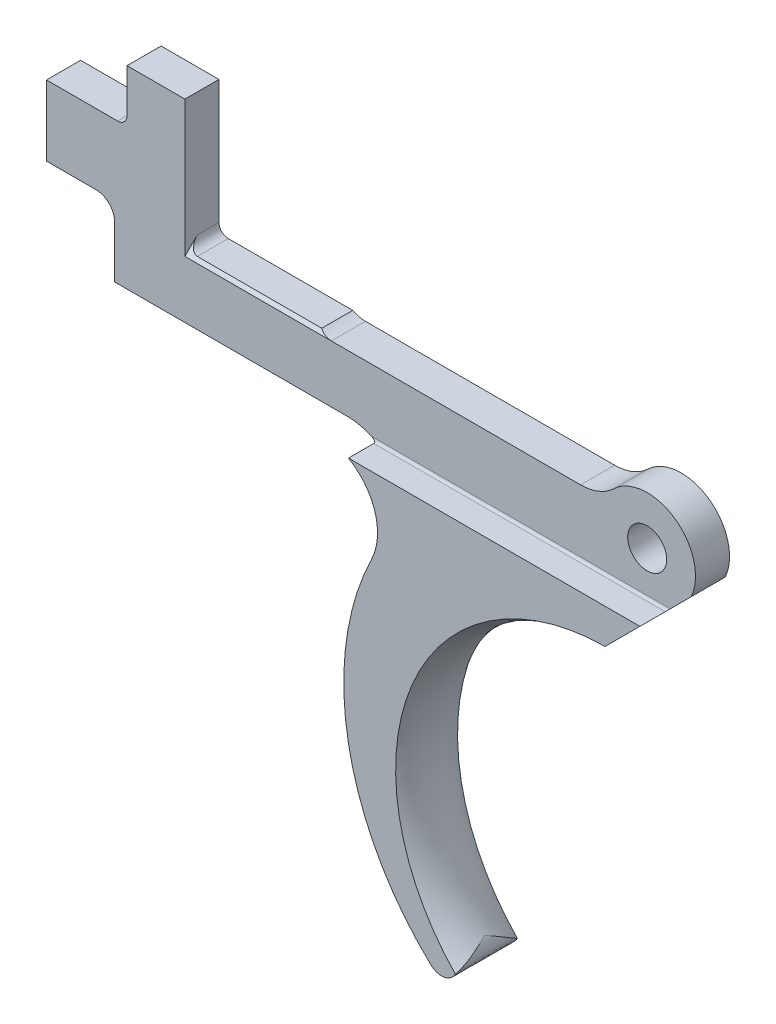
ISO-10303-21;
HEADER;
FILE_DESCRIPTION(('STEP AP214'),'2;1');
FILE_NAME('part.step','',(''),(''),'','','');
FILE_SCHEMA(('AUTOMOTIVE_DESIGN { 1 0 10303 214 1 1 1 1 }'));
ENDSEC;
DATA;
#1=APPLICATION_CONTEXT('core data for automotive mechanical design processes');
#2=APPLICATION_PROTOCOL_DEFINITION('international standard','automotive_design',2000,#1);
#3=PRODUCT_CONTEXT('',#1,'mechanical');
#4=PRODUCT('Part','Part','',(#3));
#5=PRODUCT_RELATED_PRODUCT_CATEGORY('part','',(#4));
#6=PRODUCT_DEFINITION_FORMATION('','',#4);
#7=PRODUCT_DEFINITION_CONTEXT('part definition',#1,'design');
#8=PRODUCT_DEFINITION('design','',#6,#7);
#9=PRODUCT_DEFINITION_SHAPE('','',#8);
#10=(LENGTH_UNIT() NAMED_UNIT(*) SI_UNIT(.MILLI.,.METRE.));
#11=(NAMED_UNIT(*) PLANE_ANGLE_UNIT() SI_UNIT($,.RADIAN.));
#12=(NAMED_UNIT(*) SI_UNIT($,.STERADIAN.) SOLID_ANGLE_UNIT());
#13=UNCERTAINTY_MEASURE_WITH_UNIT(LENGTH_MEASURE(1.E-05),#10,'distance_accuracy_value','');
#14=(GEOMETRIC_REPRESENTATION_CONTEXT(3) GLOBAL_UNCERTAINTY_ASSIGNED_CONTEXT((#13)) GLOBAL_UNIT_ASSIGNED_CONTEXT((#10,
#11,#12)) REPRESENTATION_CONTEXT('',''));
#15=CARTESIAN_POINT('',(0.,0.,0.));
#16=DIRECTION('',(0.,0.,1.));
#17=DIRECTION('',(1.,0.,0.));
#18=AXIS2_PLACEMENT_3D('',#15,#16,#17);
#19=CARTESIAN_POINT('',(-37.1602,2.794,2.54));
#20=DIRECTION('',(0.,0.,-1.));
#21=DIRECTION('',(-1.,0.,0.));
#22=AXIS2_PLACEMENT_3D('',#19,#20,#21);
#23=CYLINDRICAL_SURFACE('',#22,0.761999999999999);
#24=DIRECTION('',(0.,0.,-1.));
#25=VECTOR('',#24,1.);
#26=CARTESIAN_POINT('',(-37.9222,2.794,2.54));
#27=LINE('',#26,#25);
#28=CARTESIAN_POINT('',(-37.9222,2.794,-0.761999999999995));
#29=VERTEX_POINT('',#28);
#30=CARTESIAN_POINT('',(-37.9222,2.794,-2.54));
#31=VERTEX_POINT('',#30);
#32=EDGE_CURVE('E220',#29,#31,#27,.T.);
#33=ORIENTED_EDGE('',*,*,#32,.F.);
#34=CARTESIAN_POINT('',(-37.1602,2.794,-0.76199999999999));
#35=DIRECTION('',(0.,-0.707106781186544,-0.707106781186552));
#36=DIRECTION('',(0.,0.707106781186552,-0.707106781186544));
#37=AXIS2_PLACEMENT_3D('',#34,#35,#36);
#38=ELLIPSE('',#37,1.07763073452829,0.761999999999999);
#39=CARTESIAN_POINT('',(-37.1602,2.032,0.));
#40=VERTEX_POINT('',#39);
#41=EDGE_CURVE('E205',#29,#40,#38,.F.);
#42=ORIENTED_EDGE('',*,*,#41,.T.);
#43=DIRECTION('',(0.,0.,-1.));
#44=VECTOR('',#43,1.);
#45=CARTESIAN_POINT('',(-37.1602,2.032,2.54));
#46=LINE('',#45,#44);
#47=CARTESIAN_POINT('',(-37.1602,2.032,-2.54));
#48=VERTEX_POINT('',#47);
#49=EDGE_CURVE('E228',#40,#48,#46,.T.);
#50=ORIENTED_EDGE('',*,*,#49,.T.);
#51=CARTESIAN_POINT('',(-37.1602,2.794,-2.54));
#52=DIRECTION('',(0.,0.,-1.));
#53=DIRECTION('',(1.,0.,0.));
#54=AXIS2_PLACEMENT_3D('',#51,#52,#53);
#55=CIRCLE('',#54,0.761999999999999);
#56=EDGE_CURVE('E226',#48,#31,#55,.T.);
#57=ORIENTED_EDGE('',*,*,#56,.T.);
#58=EDGE_LOOP('',(#33,#42,#50,#57));
#59=FACE_BOUND('',#58,.T.);
#60=ADVANCED_FACE('F41',(#59),#23,.F.);
#61=CARTESIAN_POINT('',(-37.1602,2.794,0.254));
#62=DIRECTION('',(0.,0.,1.));
#63=DIRECTION('',(1.,0.,0.));
#64=AXIS2_PLACEMENT_3D('',#61,#62,#63);
#65=PLANE('',#64);
#66=CARTESIAN_POINT('',(0.,0.,0.254));
#67=DIRECTION('',(0.,0.,1.));
#68=DIRECTION('',(1.,0.,0.));
#69=AXIS2_PLACEMENT_3D('',#66,#67,#68);
#70=CIRCLE('',#69,1.6002);
#71=CARTESIAN_POINT('',(1.6002,0.,0.254));
#72=VERTEX_POINT('',#71);
#73=EDGE_CURVE('E434',#72,#72,#70,.T.);
#74=ORIENTED_EDGE('',*,*,#73,.F.);
#75=EDGE_LOOP('',(#74));
#76=FACE_BOUND('',#75,.T.);
#77=DIRECTION('',(1.,0.,0.));
#78=VECTOR('',#77,1.);
#79=CARTESIAN_POINT('',(-37.9222,1.778,0.254));
#80=LINE('',#79,#78);
#81=CARTESIAN_POINT('',(-37.9222,1.778,0.254));
#82=VERTEX_POINT('',#81);
#83=CARTESIAN_POINT('',(-25.908,1.778,0.254));
#84=VERTEX_POINT('',#83);
#85=EDGE_CURVE('E215',#82,#84,#80,.T.);
#86=ORIENTED_EDGE('',*,*,#85,.F.);
#87=DIRECTION('',(0.,1.,0.));
#88=VECTOR('',#87,1.);
#89=CARTESIAN_POINT('',(-37.9222,12.954,0.254));
#90=LINE('',#89,#88);
#91=CARTESIAN_POINT('',(-37.9222,12.954,0.254));
#92=VERTEX_POINT('',#91);
#93=EDGE_CURVE('E223',#82,#92,#90,.T.);
#94=ORIENTED_EDGE('',*,*,#93,.T.);
#95=DIRECTION('',(-1.,0.,0.));
#96=VECTOR('',#95,1.);
#97=CARTESIAN_POINT('',(-42.672,12.954,0.254));
#98=LINE('',#97,#96);
#99=CARTESIAN_POINT('',(-42.672,12.954,0.254));
#100=VERTEX_POINT('',#99);
#101=EDGE_CURVE('E437',#92,#100,#98,.T.);
#102=ORIENTED_EDGE('',*,*,#101,.T.);
#103=DIRECTION('',(0.,-1.,0.));
#104=VECTOR('',#103,1.);
#105=CARTESIAN_POINT('',(-42.672,9.398,0.254));
#106=LINE('',#105,#104);
#107=CARTESIAN_POINT('',(-42.672,9.39799999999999,0.254));
#108=VERTEX_POINT('',#107);
#109=EDGE_CURVE('E527',#100,#108,#106,.T.);
#110=ORIENTED_EDGE('',*,*,#109,.T.);
#111=CARTESIAN_POINT('',(-43.434,9.39799999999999,0.254));
#112=DIRECTION('',(0.,0.,1.));
#113=DIRECTION('',(1.,0.,0.));
#114=AXIS2_PLACEMENT_3D('',#111,#112,#113);
#115=CIRCLE('',#114,0.762);
#116=CARTESIAN_POINT('',(-43.434,8.63599999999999,0.254));
#117=VERTEX_POINT('',#116);
#118=EDGE_CURVE('E526',#108,#117,#115,.F.);
#119=ORIENTED_EDGE('',*,*,#118,.T.);
#120=DIRECTION('',(-1.,0.,0.));
#121=VECTOR('',#120,1.);
#122=CARTESIAN_POINT('',(-49.276,8.63599999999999,0.254));
#123=LINE('',#122,#121);
#124=CARTESIAN_POINT('',(-49.276,8.63599999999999,0.254));
#125=VERTEX_POINT('',#124);
#126=EDGE_CURVE('E559',#117,#125,#123,.T.);
#127=ORIENTED_EDGE('',*,*,#126,.T.);
#128=DIRECTION('',(0.,-1.,0.));
#129=VECTOR('',#128,1.);
#130=CARTESIAN_POINT('',(-49.276,2.8702,0.254));
#131=LINE('',#130,#129);
#132=CARTESIAN_POINT('',(-49.276,2.8702,0.254));
#133=VERTEX_POINT('',#132);
#134=EDGE_CURVE('E557',#125,#133,#131,.T.);
#135=ORIENTED_EDGE('',*,*,#134,.T.);
#136=DIRECTION('',(1.,0.,0.));
#137=VECTOR('',#136,1.);
#138=CARTESIAN_POINT('',(-49.276,2.8702,0.254));
#139=LINE('',#138,#137);
#140=CARTESIAN_POINT('',(-45.212,2.8702,0.254));
#141=VERTEX_POINT('',#140);
#142=EDGE_CURVE('E555',#133,#141,#139,.T.);
#143=ORIENTED_EDGE('',*,*,#142,.T.);
#144=CARTESIAN_POINT('',(-45.212,1.3462,0.254));
#145=DIRECTION('',(0.,0.,1.));
#146=DIRECTION('',(1.,0.,0.));
#147=AXIS2_PLACEMENT_3D('',#144,#145,#146);
#148=CIRCLE('',#147,1.524);
#149=CARTESIAN_POINT('',(-43.688,1.3462,0.254));
#150=VERTEX_POINT('',#149);
#151=EDGE_CURVE('E553',#141,#150,#148,.F.);
#152=ORIENTED_EDGE('',*,*,#151,.T.);
#153=DIRECTION('',(0.,-1.,0.));
#154=VECTOR('',#153,1.);
#155=CARTESIAN_POINT('',(-43.688,1.34619999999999,0.254));
#156=LINE('',#155,#154);
#157=CARTESIAN_POINT('',(-43.688,-2.92100000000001,0.254));
#158=VERTEX_POINT('',#157);
#159=EDGE_CURVE('E551',#150,#158,#156,.T.);
#160=ORIENTED_EDGE('',*,*,#159,.T.);
#161=DIRECTION('',(1.,0.,0.));
#162=VECTOR('',#161,1.);
#163=CARTESIAN_POINT('',(-43.688,-2.92100000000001,0.254));
#164=LINE('',#163,#162);
#165=CARTESIAN_POINT('',(-24.5967231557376,-2.92100000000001,0.254));
#166=VERTEX_POINT('',#165);
#167=EDGE_CURVE('E549',#158,#166,#164,.T.);
#168=ORIENTED_EDGE('',*,*,#167,.T.);
#169=CARTESIAN_POINT('',(-24.5967231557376,-7.68350000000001,0.254));
#170=DIRECTION('',(0.,0.,1.));
#171=DIRECTION('',(1.,0.,0.));
#172=AXIS2_PLACEMENT_3D('',#169,#170,#171);
#173=CIRCLE('',#172,4.7625);
#174=CARTESIAN_POINT('',(-22.6151975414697,-3.3528,0.254));
#175=VERTEX_POINT('',#174);
#176=EDGE_CURVE('E547',#166,#175,#173,.F.);
#177=ORIENTED_EDGE('',*,*,#176,.T.);
#178=DIRECTION('',(-1.,0.,0.));
#179=VECTOR('',#178,1.);
#180=CARTESIAN_POINT('',(-37.1602,-3.3528,0.254));
#181=LINE('',#180,#179);
#182=CARTESIAN_POINT('',(1.89166957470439,-3.3528,0.254));
#183=VERTEX_POINT('',#182);
#184=EDGE_CURVE('E57',#175,#183,#181,.F.);
#185=ORIENTED_EDGE('',*,*,#184,.T.);
#186=DIRECTION('',(0.707106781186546,0.707106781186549,0.));
#187=VECTOR('',#186,1.);
#188=CARTESIAN_POINT('',(3.60924623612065,-1.63522333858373,0.254));
#189=LINE('',#188,#187);
#190=CARTESIAN_POINT('',(3.60924623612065,-1.63522333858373,0.254));
#191=VERTEX_POINT('',#190);
#192=EDGE_CURVE('E522',#183,#191,#189,.T.);
#193=ORIENTED_EDGE('',*,*,#192,.T.);
#194=CARTESIAN_POINT('',(0.,0.,0.254));
#195=DIRECTION('',(0.,0.,1.));
#196=DIRECTION('',(1.,0.,0.));
#197=AXIS2_PLACEMENT_3D('',#194,#195,#196);
#198=CIRCLE('',#197,3.9624);
#199=CARTESIAN_POINT('',(-2.73176970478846,2.8702,0.254));
#200=VERTEX_POINT('',#199);
#201=EDGE_CURVE('E563',#191,#200,#198,.T.);
#202=ORIENTED_EDGE('',*,*,#201,.T.);
#203=CARTESIAN_POINT('',(-5.46353940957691,5.7404,0.254));
#204=DIRECTION('',(0.,0.,1.));
#205=DIRECTION('',(1.,0.,0.));
#206=AXIS2_PLACEMENT_3D('',#203,#204,#205);
#207=CIRCLE('',#206,3.9624);
#208=CARTESIAN_POINT('',(-5.46353940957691,1.778,0.254));
#209=VERTEX_POINT('',#208);
#210=EDGE_CURVE('E565',#200,#209,#207,.F.);
#211=ORIENTED_EDGE('',*,*,#210,.T.);
#212=DIRECTION('',(-1.,0.,0.));
#213=VECTOR('',#212,1.);
#214=CARTESIAN_POINT('',(-25.908,1.778,0.254));
#215=LINE('',#214,#213);
#216=EDGE_CURVE('E567',#209,#84,#215,.T.);
#217=ORIENTED_EDGE('',*,*,#216,.T.);
#218=EDGE_LOOP('',(#86,#94,#102,#110,#119,#127,#135,#143,#152,#160,#168,#177,#185,#193,#202,
#211,#217));
#219=FACE_BOUND('',#218,.T.);
#220=ADVANCED_FACE('F483',(#76,#219),#65,.T.);
#221=CARTESIAN_POINT('',(-42.672,9.398,2.54));
#222=DIRECTION('',(1.,0.,0.));
#223=DIRECTION('',(0.,0.,-1.));
#224=AXIS2_PLACEMENT_3D('',#221,#222,#223);
#225=PLANE('',#224);
#226=ORIENTED_EDGE('',*,*,#109,.F.);
#227=DIRECTION('',(0.,0.,-1.));
#228=VECTOR('',#227,1.);
#229=CARTESIAN_POINT('',(-42.672,12.954,2.54));
#230=LINE('',#229,#228);
#231=CARTESIAN_POINT('',(-42.672,12.954,-2.54));
#232=VERTEX_POINT('',#231);
#233=EDGE_CURVE('E233',#100,#232,#230,.T.);
#234=ORIENTED_EDGE('',*,*,#233,.T.);
#235=DIRECTION('',(0.,-1.,0.));
#236=VECTOR('',#235,1.);
#237=CARTESIAN_POINT('',(-42.672,9.398,-2.54));
#238=LINE('',#237,#236);
#239=CARTESIAN_POINT('',(-42.672,9.39799999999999,-2.54));
#240=VERTEX_POINT('',#239);
#241=EDGE_CURVE('E317',#232,#240,#238,.T.);
#242=ORIENTED_EDGE('',*,*,#241,.T.);
#243=DIRECTION('',(0.,0.,-1.));
#244=VECTOR('',#243,1.);
#245=CARTESIAN_POINT('',(-42.672,9.39799999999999,2.54));
#246=LINE('',#245,#244);
#247=EDGE_CURVE('E263',#108,#240,#246,.T.);
#248=ORIENTED_EDGE('',*,*,#247,.F.);
#249=EDGE_LOOP('',(#226,#234,#242,#248));
#250=FACE_BOUND('',#249,.T.);
#251=ADVANCED_FACE('F394',(#250),#225,.F.);
#252=CARTESIAN_POINT('',(-43.434,9.39799999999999,2.54));
#253=DIRECTION('',(0.,0.,-1.));
#254=DIRECTION('',(-1.,0.,0.));
#255=AXIS2_PLACEMENT_3D('',#252,#253,#254);
#256=CYLINDRICAL_SURFACE('',#255,0.762);
#257=ORIENTED_EDGE('',*,*,#118,.F.);
#258=ORIENTED_EDGE('',*,*,#247,.T.);
#259=CARTESIAN_POINT('',(-43.434,9.39799999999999,-2.54));
#260=DIRECTION('',(0.,0.,-1.));
#261=DIRECTION('',(1.,0.,0.));
#262=AXIS2_PLACEMENT_3D('',#259,#260,#261);
#263=CIRCLE('',#262,0.762);
#264=CARTESIAN_POINT('',(-43.434,8.63599999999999,-2.54));
#265=VERTEX_POINT('',#264);
#266=EDGE_CURVE('E319',#240,#265,#263,.T.);
#267=ORIENTED_EDGE('',*,*,#266,.T.);
#268=DIRECTION('',(0.,0.,-1.));
#269=VECTOR('',#268,1.);
#270=CARTESIAN_POINT('',(-43.434,8.63599999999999,2.54));
#271=LINE('',#270,#269);
#272=EDGE_CURVE('E261',#117,#265,#271,.T.);
#273=ORIENTED_EDGE('',*,*,#272,.F.);
#274=EDGE_LOOP('',(#257,#258,#267,#273));
#275=FACE_BOUND('',#274,.T.);
#276=ADVANCED_FACE('F476',(#275),#256,.F.);
#277=CARTESIAN_POINT('',(-49.276,8.63599999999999,2.54));
#278=DIRECTION('',(0.,-1.,0.));
#279=DIRECTION('',(0.,0.,-1.));
#280=AXIS2_PLACEMENT_3D('',#277,#278,#279);
#281=PLANE('',#280);
#282=ORIENTED_EDGE('',*,*,#126,.F.);
#283=ORIENTED_EDGE('',*,*,#272,.T.);
#284=DIRECTION('',(-1.,0.,0.));
#285=VECTOR('',#284,1.);
#286=CARTESIAN_POINT('',(-49.276,8.63599999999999,-2.54));
#287=LINE('',#286,#285);
#288=CARTESIAN_POINT('',(-49.276,8.63599999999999,-2.54));
#289=VERTEX_POINT('',#288);
#290=EDGE_CURVE('E323',#265,#289,#287,.T.);
#291=ORIENTED_EDGE('',*,*,#290,.T.);
#292=DIRECTION('',(0.,0.,-1.));
#293=VECTOR('',#292,1.);
#294=CARTESIAN_POINT('',(-49.276,8.63599999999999,2.54));
#295=LINE('',#294,#293);
#296=EDGE_CURVE('E259',#125,#289,#295,.T.);
#297=ORIENTED_EDGE('',*,*,#296,.F.);
#298=EDGE_LOOP('',(#282,#283,#291,#297));
#299=FACE_BOUND('',#298,.T.);
#300=ADVANCED_FACE('F473',(#299),#281,.F.);
#301=CARTESIAN_POINT('',(-49.276,2.8702,2.54));
#302=DIRECTION('',(1.,0.,0.));
#303=DIRECTION('',(0.,0.,-1.));
#304=AXIS2_PLACEMENT_3D('',#301,#302,#303);
#305=PLANE('',#304);
#306=ORIENTED_EDGE('',*,*,#134,.F.);
#307=ORIENTED_EDGE('',*,*,#296,.T.);
#308=DIRECTION('',(0.,-1.,0.));
#309=VECTOR('',#308,1.);
#310=CARTESIAN_POINT('',(-49.276,2.8702,-2.54));
#311=LINE('',#310,#309);
#312=CARTESIAN_POINT('',(-49.276,2.8702,-2.54));
#313=VERTEX_POINT('',#312);
#314=EDGE_CURVE('E326',#289,#313,#311,.T.);
#315=ORIENTED_EDGE('',*,*,#314,.T.);
#316=DIRECTION('',(0.,0.,-1.));
#317=VECTOR('',#316,1.);
#318=CARTESIAN_POINT('',(-49.276,2.8702,2.54));
#319=LINE('',#318,#317);
#320=EDGE_CURVE('E257',#133,#313,#319,.T.);
#321=ORIENTED_EDGE('',*,*,#320,.F.);
#322=EDGE_LOOP('',(#306,#307,#315,#321));
#323=FACE_BOUND('',#322,.T.);
#324=ADVANCED_FACE('F469',(#323),#305,.F.);
#325=CARTESIAN_POINT('',(-49.276,2.8702,2.54));
#326=DIRECTION('',(0.,1.,0.));
#327=DIRECTION('',(-1.,0.,0.));
#328=AXIS2_PLACEMENT_3D('',#325,#326,#327);
#329=PLANE('',#328);
#330=ORIENTED_EDGE('',*,*,#142,.F.);
#331=ORIENTED_EDGE('',*,*,#320,.T.);
#332=DIRECTION('',(1.,0.,0.));
#333=VECTOR('',#332,1.);
#334=CARTESIAN_POINT('',(-49.276,2.8702,-2.54));
#335=LINE('',#334,#333);
#336=CARTESIAN_POINT('',(-45.212,2.8702,-2.54));
#337=VERTEX_POINT('',#336);
#338=EDGE_CURVE('E329',#313,#337,#335,.T.);
#339=ORIENTED_EDGE('',*,*,#338,.T.);
#340=DIRECTION('',(0.,0.,-1.));
#341=VECTOR('',#340,1.);
#342=CARTESIAN_POINT('',(-45.212,2.8702,2.54));
#343=LINE('',#342,#341);
#344=EDGE_CURVE('E255',#141,#337,#343,.T.);
#345=ORIENTED_EDGE('',*,*,#344,.F.);
#346=EDGE_LOOP('',(#330,#331,#339,#345));
#347=FACE_BOUND('',#346,.T.);
#348=ADVANCED_FACE('F465',(#347),#329,.F.);
#349=CARTESIAN_POINT('',(-45.212,1.3462,2.54));
#350=DIRECTION('',(0.,0.,-1.));
#351=DIRECTION('',(-1.,0.,0.));
#352=AXIS2_PLACEMENT_3D('',#349,#350,#351);
#353=CYLINDRICAL_SURFACE('',#352,1.524);
#354=ORIENTED_EDGE('',*,*,#151,.F.);
#355=ORIENTED_EDGE('',*,*,#344,.T.);
#356=CARTESIAN_POINT('',(-45.212,1.3462,-2.54));
#357=DIRECTION('',(0.,0.,-1.));
#358=DIRECTION('',(-1.,0.,0.));
#359=AXIS2_PLACEMENT_3D('',#356,#357,#358);
#360=CIRCLE('',#359,1.524);
#361=CARTESIAN_POINT('',(-43.688,1.34619999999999,-2.54));
#362=VERTEX_POINT('',#361);
#363=EDGE_CURVE('E332',#337,#362,#360,.T.);
#364=ORIENTED_EDGE('',*,*,#363,.T.);
#365=DIRECTION('',(0.,0.,-1.));
#366=VECTOR('',#365,1.);
#367=CARTESIAN_POINT('',(-43.688,1.34619999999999,2.54));
#368=LINE('',#367,#366);
#369=EDGE_CURVE('E253',#150,#362,#368,.T.);
#370=ORIENTED_EDGE('',*,*,#369,.F.);
#371=EDGE_LOOP('',(#354,#355,#364,#370));
#372=FACE_BOUND('',#371,.T.);
#373=ADVANCED_FACE('F461',(#372),#353,.F.);
#374=CARTESIAN_POINT('',(-43.688,1.34619999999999,2.54));
#375=DIRECTION('',(1.,0.,0.));
#376=DIRECTION('',(0.,0.,-1.));
#377=AXIS2_PLACEMENT_3D('',#374,#375,#376);
#378=PLANE('',#377);
#379=ORIENTED_EDGE('',*,*,#159,.F.);
#380=ORIENTED_EDGE('',*,*,#369,.T.);
#381=DIRECTION('',(0.,-1.,0.));
#382=VECTOR('',#381,1.);
#383=CARTESIAN_POINT('',(-43.688,1.34619999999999,-2.54));
#384=LINE('',#383,#382);
#385=CARTESIAN_POINT('',(-43.688,-2.92100000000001,-2.54));
#386=VERTEX_POINT('',#385);
#387=EDGE_CURVE('E335',#362,#386,#384,.T.);
#388=ORIENTED_EDGE('',*,*,#387,.T.);
#389=DIRECTION('',(0.,0.,-1.));
#390=VECTOR('',#389,1.);
#391=CARTESIAN_POINT('',(-43.688,-2.92100000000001,2.54));
#392=LINE('',#391,#390);
#393=EDGE_CURVE('E251',#158,#386,#392,.T.);
#394=ORIENTED_EDGE('',*,*,#393,.F.);
#395=EDGE_LOOP('',(#379,#380,#388,#394));
#396=FACE_BOUND('',#395,.T.);
#397=ADVANCED_FACE('F458',(#396),#378,.F.);
#398=CARTESIAN_POINT('',(-43.688,-2.92100000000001,2.54));
#399=DIRECTION('',(0.,1.,0.));
#400=DIRECTION('',(-1.,0.,0.));
#401=AXIS2_PLACEMENT_3D('',#398,#399,#400);
#402=PLANE('',#401);
#403=ORIENTED_EDGE('',*,*,#167,.F.);
#404=ORIENTED_EDGE('',*,*,#393,.T.);
#405=DIRECTION('',(1.,0.,0.));
#406=VECTOR('',#405,1.);
#407=CARTESIAN_POINT('',(-43.688,-2.92100000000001,-2.54));
#408=LINE('',#407,#406);
#409=CARTESIAN_POINT('',(-24.5967231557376,-2.92100000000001,-2.54));
#410=VERTEX_POINT('',#409);
#411=EDGE_CURVE('E337',#386,#410,#408,.T.);
#412=ORIENTED_EDGE('',*,*,#411,.T.);
#413=DIRECTION('',(0.,0.,-1.));
#414=VECTOR('',#413,1.);
#415=CARTESIAN_POINT('',(-24.5967231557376,-2.92100000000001,2.54));
#416=LINE('',#415,#414);
#417=EDGE_CURVE('E249',#166,#410,#416,.T.);
#418=ORIENTED_EDGE('',*,*,#417,.F.);
#419=EDGE_LOOP('',(#403,#404,#412,#418));
#420=FACE_BOUND('',#419,.T.);
#421=ADVANCED_FACE('F454',(#420),#402,.F.);
#422=CARTESIAN_POINT('',(0.,0.,2.54));
#423=DIRECTION('',(0.,0.,-1.));
#424=DIRECTION('',(-1.,0.,0.));
#425=AXIS2_PLACEMENT_3D('',#422,#423,#424);
#426=CYLINDRICAL_SURFACE('',#425,3.9624);
#427=ORIENTED_EDGE('',*,*,#201,.F.);
#428=DIRECTION('',(0.,0.,-1.));
#429=VECTOR('',#428,1.);
#430=CARTESIAN_POINT('',(3.60924623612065,-1.63522333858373,2.54));
#431=LINE('',#430,#429);
#432=CARTESIAN_POINT('',(3.60924623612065,-1.63522333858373,-2.54));
#433=VERTEX_POINT('',#432);
#434=EDGE_CURVE('E244',#191,#433,#431,.T.);
#435=ORIENTED_EDGE('',*,*,#434,.T.);
#436=CARTESIAN_POINT('',(0.,0.,-2.54));
#437=DIRECTION('',(0.,0.,1.));
#438=DIRECTION('',(-1.,0.,0.));
#439=AXIS2_PLACEMENT_3D('',#436,#437,#438);
#440=CIRCLE('',#439,3.9624);
#441=CARTESIAN_POINT('',(-2.73176970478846,2.8702,-2.54));
#442=VERTEX_POINT('',#441);
#443=EDGE_CURVE('E281',#433,#442,#440,.T.);
#444=ORIENTED_EDGE('',*,*,#443,.T.);
#445=DIRECTION('',(0.,0.,-1.));
#446=VECTOR('',#445,1.);
#447=CARTESIAN_POINT('',(-2.73176970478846,2.8702,2.54));
#448=LINE('',#447,#446);
#449=EDGE_CURVE('E242',#200,#442,#448,.T.);
#450=ORIENTED_EDGE('',*,*,#449,.F.);
#451=EDGE_LOOP('',(#427,#435,#444,#450));
#452=FACE_BOUND('',#451,.T.);
#453=ADVANCED_FACE('F457',(#452),#426,.T.);
#454=CARTESIAN_POINT('',(-5.46353940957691,5.7404,2.54));
#455=DIRECTION('',(0.,0.,-1.));
#456=DIRECTION('',(-1.,0.,0.));
#457=AXIS2_PLACEMENT_3D('',#454,#455,#456);
#458=CYLINDRICAL_SURFACE('',#457,3.9624);
#459=ORIENTED_EDGE('',*,*,#210,.F.);
#460=ORIENTED_EDGE('',*,*,#449,.T.);
#461=CARTESIAN_POINT('',(-5.46353940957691,5.7404,-2.54));
#462=DIRECTION('',(0.,0.,-1.));
#463=DIRECTION('',(1.,0.,0.));
#464=AXIS2_PLACEMENT_3D('',#461,#462,#463);
#465=CIRCLE('',#464,3.9624);
#466=CARTESIAN_POINT('',(-5.46353940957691,1.778,-2.54));
#467=VERTEX_POINT('',#466);
#468=EDGE_CURVE('E284',#442,#467,#465,.T.);
#469=ORIENTED_EDGE('',*,*,#468,.T.);
#470=DIRECTION('',(0.,0.,-1.));
#471=VECTOR('',#470,1.);
#472=CARTESIAN_POINT('',(-5.46353940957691,1.778,2.54));
#473=LINE('',#472,#471);
#474=EDGE_CURVE('E240',#209,#467,#473,.T.);
#475=ORIENTED_EDGE('',*,*,#474,.F.);
#476=EDGE_LOOP('',(#459,#460,#469,#475));
#477=FACE_BOUND('',#476,.T.);
#478=ADVANCED_FACE('F506',(#477),#458,.F.);
#479=CARTESIAN_POINT('',(-25.908,1.778,2.54));
#480=DIRECTION('',(0.,-1.,0.));
#481=DIRECTION('',(1.,0.,0.));
#482=AXIS2_PLACEMENT_3D('',#479,#480,#481);
#483=PLANE('',#482);
#484=ORIENTED_EDGE('',*,*,#216,.F.);
#485=ORIENTED_EDGE('',*,*,#474,.T.);
#486=DIRECTION('',(-1.,0.,0.));
#487=VECTOR('',#486,1.);
#488=CARTESIAN_POINT('',(-25.908,1.778,-2.54));
#489=LINE('',#488,#487);
#490=CARTESIAN_POINT('',(-25.908,1.778,-2.54));
#491=VERTEX_POINT('',#490);
#492=EDGE_CURVE('E287',#467,#491,#489,.T.);
#493=ORIENTED_EDGE('',*,*,#492,.T.);
#494=DIRECTION('',(0.,0.,-1.));
#495=VECTOR('',#494,1.);
#496=CARTESIAN_POINT('',(-25.908,1.778,2.54));
#497=LINE('',#496,#495);
#498=EDGE_CURVE('E238',#84,#491,#497,.T.);
#499=ORIENTED_EDGE('',*,*,#498,.F.);
#500=EDGE_LOOP('',(#484,#485,#493,#499));
#501=FACE_BOUND('',#500,.T.);
#502=ADVANCED_FACE('F502',(#501),#483,.F.);
#503=CARTESIAN_POINT('',(-25.908,4.064,2.54));
#504=DIRECTION('',(0.,0.,-1.));
#505=DIRECTION('',(-1.,0.,0.));
#506=AXIS2_PLACEMENT_3D('',#503,#504,#505);
#507=CYLINDRICAL_SURFACE('',#506,2.286);
#508=DIRECTION('',(0.,0.,-1.));
#509=VECTOR('',#508,1.);
#510=CARTESIAN_POINT('',(-26.9552688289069,2.032,2.54));
#511=LINE('',#510,#509);
#512=CARTESIAN_POINT('',(-26.9552688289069,2.032,0.));
#513=VERTEX_POINT('',#512);
#514=CARTESIAN_POINT('',(-26.9552688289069,2.032,-2.54));
#515=VERTEX_POINT('',#514);
#516=EDGE_CURVE('E231',#513,#515,#511,.T.);
#517=ORIENTED_EDGE('',*,*,#516,.F.);
#518=CARTESIAN_POINT('',(-25.908,4.064,-2.03199999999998));
#519=DIRECTION('',(0.,-0.707106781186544,-0.707106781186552));
#520=DIRECTION('',(0.,0.707106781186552,-0.707106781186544));
#521=AXIS2_PLACEMENT_3D('',#518,#519,#520);
#522=ELLIPSE('',#521,3.23289220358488,2.286);
#523=EDGE_CURVE('E573',#513,#84,#522,.F.);
#524=ORIENTED_EDGE('',*,*,#523,.T.);
#525=ORIENTED_EDGE('',*,*,#498,.T.);
#526=CARTESIAN_POINT('',(-25.908,4.064,-2.54));
#527=DIRECTION('',(0.,0.,-1.));
#528=DIRECTION('',(-1.,0.,0.));
#529=AXIS2_PLACEMENT_3D('',#526,#527,#528);
#530=CIRCLE('',#529,2.286);
#531=EDGE_CURVE('E290',#491,#515,#530,.T.);
#532=ORIENTED_EDGE('',*,*,#531,.T.);
#533=EDGE_LOOP('',(#517,#524,#525,#532));
#534=FACE_BOUND('',#533,.T.);
#535=ADVANCED_FACE('F498',(#534),#507,.F.);
#536=CARTESIAN_POINT('',(-37.1602,2.032,2.54));
#537=DIRECTION('',(0.,-1.,0.));
#538=DIRECTION('',(1.,0.,0.));
#539=AXIS2_PLACEMENT_3D('',#536,#537,#538);
#540=PLANE('',#539);
#541=ORIENTED_EDGE('',*,*,#49,.F.);
#542=DIRECTION('',(1.,0.,0.));
#543=VECTOR('',#542,1.);
#544=CARTESIAN_POINT('',(-37.1602,2.032,0.));
#545=LINE('',#544,#543);
#546=EDGE_CURVE('E211',#40,#513,#545,.T.);
#547=ORIENTED_EDGE('',*,*,#546,.T.);
#548=ORIENTED_EDGE('',*,*,#516,.T.);
#549=DIRECTION('',(-1.,0.,0.));
#550=VECTOR('',#549,1.);
#551=CARTESIAN_POINT('',(-37.1602,2.032,-2.54));
#552=LINE('',#551,#550);
#553=EDGE_CURVE('E293',#515,#48,#552,.T.);
#554=ORIENTED_EDGE('',*,*,#553,.T.);
#555=EDGE_LOOP('',(#541,#547,#548,#554));
#556=FACE_BOUND('',#555,.T.);
#557=ADVANCED_FACE('F495',(#556),#540,.F.);
#558=CARTESIAN_POINT('',(-37.9222,12.954,2.54));
#559=DIRECTION('',(-1.,0.,0.));
#560=DIRECTION('',(0.,0.,1.));
#561=AXIS2_PLACEMENT_3D('',#558,#559,#560);
#562=PLANE('',#561);
#563=ORIENTED_EDGE('',*,*,#93,.F.);
#564=DIRECTION('',(0.,0.707106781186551,-0.707106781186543));
#565=VECTOR('',#564,1.);
#566=CARTESIAN_POINT('',(-37.9222,2.159,-0.126999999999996));
#567=LINE('',#566,#565);
#568=EDGE_CURVE('E209',#82,#29,#567,.T.);
#569=ORIENTED_EDGE('',*,*,#568,.T.);
#570=ORIENTED_EDGE('',*,*,#32,.T.);
#571=DIRECTION('',(0.,1.,0.));
#572=VECTOR('',#571,1.);
#573=CARTESIAN_POINT('',(-37.9222,12.954,-2.54));
#574=LINE('',#573,#572);
#575=CARTESIAN_POINT('',(-37.9222,12.954,-2.54));
#576=VERTEX_POINT('',#575);
#577=EDGE_CURVE('E297',#31,#576,#574,.T.);
#578=ORIENTED_EDGE('',*,*,#577,.T.);
#579=DIRECTION('',(0.,0.,-1.));
#580=VECTOR('',#579,1.);
#581=CARTESIAN_POINT('',(-37.9222,12.954,2.54));
#582=LINE('',#581,#580);
#583=EDGE_CURVE('E229',#92,#576,#582,.T.);
#584=ORIENTED_EDGE('',*,*,#583,.F.);
#585=EDGE_LOOP('',(#563,#569,#570,#578,#584));
#586=FACE_BOUND('',#585,.T.);
#587=ADVANCED_FACE('F218',(#586),#562,.F.);
#588=CARTESIAN_POINT('',(-42.672,12.954,2.54));
#589=DIRECTION('',(0.,-1.,0.));
#590=DIRECTION('',(0.,0.,-1.));
#591=AXIS2_PLACEMENT_3D('',#588,#589,#590);
#592=PLANE('',#591);
#593=ORIENTED_EDGE('',*,*,#101,.F.);
#594=ORIENTED_EDGE('',*,*,#583,.T.);
#595=DIRECTION('',(-1.,0.,0.));
#596=VECTOR('',#595,1.);
#597=CARTESIAN_POINT('',(-42.672,12.954,-2.54));
#598=LINE('',#597,#596);
#599=EDGE_CURVE('E299',#576,#232,#598,.T.);
#600=ORIENTED_EDGE('',*,*,#599,.T.);
#601=ORIENTED_EDGE('',*,*,#233,.F.);
#602=EDGE_LOOP('',(#593,#594,#600,#601));
#603=FACE_BOUND('',#602,.T.);
#604=ADVANCED_FACE('F590',(#603),#592,.F.);
#605=CARTESIAN_POINT('',(0.,0.,2.54));
#606=DIRECTION('',(0.,0.,-1.));
#607=DIRECTION('',(-1.,0.,0.));
#608=AXIS2_PLACEMENT_3D('',#605,#606,#607);
#609=CYLINDRICAL_SURFACE('',#608,1.6002);
#610=CARTESIAN_POINT('',(0.,0.,-2.54));
#611=DIRECTION('',(0.,0.,1.));
#612=DIRECTION('',(1.,0.,0.));
#613=AXIS2_PLACEMENT_3D('',#610,#611,#612);
#614=CIRCLE('',#613,1.6002);
#615=CARTESIAN_POINT('',(1.6002,0.,-2.54));
#616=VERTEX_POINT('',#615);
#617=EDGE_CURVE('E320',#616,#616,#614,.T.);
#618=ORIENTED_EDGE('',*,*,#617,.F.);
#619=EDGE_LOOP('',(#618));
#620=FACE_BOUND('',#619,.T.);
#621=ORIENTED_EDGE('',*,*,#73,.T.);
#622=EDGE_LOOP('',(#621));
#623=FACE_BOUND('',#622,.T.);
#624=ADVANCED_FACE('F393',(#620,#623),#609,.F.);
#625=CARTESIAN_POINT('',(-13.611101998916,-34.4234323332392,3.048));
#626=CARTESIAN_POINT('',(-13.611101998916,-34.4234323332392,2.87866666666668));
#627=CARTESIAN_POINT('',(-13.6111019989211,-34.4234323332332,2.70933333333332));
#628=CARTESIAN_POINT('',(-13.6111019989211,-34.4234323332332,0.846666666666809));
#629=CARTESIAN_POINT('',(-13.6111019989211,-34.4234323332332,-0.846666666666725));
#630=CARTESIAN_POINT('',(-13.6111019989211,-34.4234323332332,-2.70933333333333));
#631=CARTESIAN_POINT('',(-13.611101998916,-34.4234323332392,-2.87866666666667));
#632=CARTESIAN_POINT('',(-13.611101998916,-34.4234323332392,-3.048));
#633=CARTESIAN_POINT('',(-12.1328537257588,-36.167664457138,3.048));
#634=CARTESIAN_POINT('',(-12.1328537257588,-36.167664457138,2.87866666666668));
#635=CARTESIAN_POINT('',(-12.1328537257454,-36.1676644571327,2.70933333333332));
#636=CARTESIAN_POINT('',(-12.1328537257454,-36.1676644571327,0.846666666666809));
#637=CARTESIAN_POINT('',(-12.1328537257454,-36.1676644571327,-0.846666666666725));
#638=CARTESIAN_POINT('',(-12.1328537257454,-36.1676644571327,-2.70933333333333));
#639=CARTESIAN_POINT('',(-12.1328537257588,-36.167664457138,-2.87866666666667));
#640=CARTESIAN_POINT('',(-12.1328537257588,-36.167664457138,-3.048));
#641=CARTESIAN_POINT('',(-13.7894013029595,-37.7435495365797,3.048));
#642=CARTESIAN_POINT('',(-13.7894013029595,-37.7435495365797,2.87866666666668));
#643=CARTESIAN_POINT('',(-13.7894013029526,-37.7435495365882,2.70933333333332));
#644=CARTESIAN_POINT('',(-13.7894013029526,-37.7435495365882,0.846666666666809));
#645=CARTESIAN_POINT('',(-13.7894013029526,-37.7435495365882,-0.846666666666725));
#646=CARTESIAN_POINT('',(-13.7894013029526,-37.7435495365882,-2.70933333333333));
#647=CARTESIAN_POINT('',(-13.7894013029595,-37.7435495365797,-2.87866666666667));
#648=CARTESIAN_POINT('',(-13.7894013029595,-37.7435495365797,-3.048));
#649=CARTESIAN_POINT('',(-15.4577316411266,-36.1801437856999,3.048));
#650=CARTESIAN_POINT('',(-15.4577316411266,-36.1801437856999,2.87866666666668));
#651=CARTESIAN_POINT('',(-15.4577316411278,-36.1801437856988,2.70933333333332));
#652=CARTESIAN_POINT('',(-15.4577316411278,-36.1801437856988,0.846666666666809));
#653=CARTESIAN_POINT('',(-15.4577316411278,-36.1801437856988,-0.846666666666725));
#654=CARTESIAN_POINT('',(-15.4577316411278,-36.1801437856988,-2.70933333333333));
#655=CARTESIAN_POINT('',(-15.4577316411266,-36.1801437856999,-2.87866666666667));
#656=CARTESIAN_POINT('',(-15.4577316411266,-36.1801437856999,-3.048));
#657=(BOUNDED_SURFACE() B_SPLINE_SURFACE(3,3,((#625,#626,#627,#628,#629,#630,#631,#632),(#633,
#634,#635,#636,#637,#638,#639,#640),(#641,#642,#643,#644,#645,#646,#647,#648),(#649,#650,#651,
#652,#653,#654,#655,#656)),.UNSPECIFIED.,.F.,.F.,.F.) B_SPLINE_SURFACE_WITH_KNOTS((4,4),(4,2,2,
4),(0.,1.),(-0.1,0.,1.,1.1),
.UNSPECIFIED.) GEOMETRIC_REPRESENTATION_ITEM() RATIONAL_B_SPLINE_SURFACE(((1.,1.,1.,1.,1.,1.,1.,
1.),(0.37158197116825,0.37158197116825,0.371581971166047,0.371581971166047,0.371581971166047,
0.371581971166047,0.37158197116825,0.37158197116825),(0.37158197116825,0.37158197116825,
0.371581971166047,0.371581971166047,0.371581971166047,0.371581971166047,0.37158197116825,
0.37158197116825),(1.,1.,1.,1.,1.,1.,1.,1.))) REPRESENTATION_ITEM('') SURFACE());
#658=CARTESIAN_POINT('',(-15.4577316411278,-36.1801437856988,-2.54));
#659=CARTESIAN_POINT('',(-13.7894013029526,-37.7435495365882,-2.54));
#660=CARTESIAN_POINT('',(-12.1328537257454,-36.1676644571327,-2.54));
#661=CARTESIAN_POINT('',(-13.6111019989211,-34.4234323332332,-2.54));
#662=(BOUNDED_CURVE() B_SPLINE_CURVE(3,(#658,#659,#660,#661),.UNSPECIFIED.,.F.,
.F.) B_SPLINE_CURVE_WITH_KNOTS((4,4),(0.,1.),
.UNSPECIFIED.) CURVE() GEOMETRIC_REPRESENTATION_ITEM() RATIONAL_B_SPLINE_CURVE((1.,
0.371581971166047,0.371581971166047,1.)) REPRESENTATION_ITEM(''));
#663=CARTESIAN_POINT('',(-13.4470298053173,-35.8308713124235,-2.54));
#664=VERTEX_POINT('',#663);
#665=CARTESIAN_POINT('',(-15.4577316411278,-36.1801437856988,-2.54));
#666=VERTEX_POINT('',#665);
#667=EDGE_CURVE('E356',#664,#666,#662,.F.);
#668=CARTESIAN_POINT('',(-13.4482490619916,-35.8296069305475,-2.54));
#669=CARTESIAN_POINT('',(-13.4300990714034,-35.7940723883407,-2.48797308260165));
#670=CARTESIAN_POINT('',(-13.41395838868,-35.7583981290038,-2.43536724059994));
#671=CARTESIAN_POINT('',(-13.3854354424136,-35.687087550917,-2.32924741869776));
#672=CARTESIAN_POINT('',(-13.373047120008,-35.6514512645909,-2.27573505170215));
#673=CARTESIAN_POINT('',(-13.3517154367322,-35.5804296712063,-2.16790122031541));
#674=CARTESIAN_POINT('',(-13.3427708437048,-35.5450442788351,-2.11358005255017));
#675=CARTESIAN_POINT('',(-13.328073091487,-35.4747224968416,-2.00427127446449));
#676=CARTESIAN_POINT('',(-13.3223179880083,-35.4397858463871,-1.9492840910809));
#677=CARTESIAN_POINT('',(-13.3137615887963,-35.3704834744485,-1.83870192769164));
#678=CARTESIAN_POINT('',(-13.3109612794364,-35.3361179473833,-1.78310675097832));
#679=CARTESIAN_POINT('',(-13.3081142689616,-35.2680951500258,-1.67141902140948));
#680=CARTESIAN_POINT('',(-13.3080674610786,-35.2344378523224,-1.61532648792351));
#681=CARTESIAN_POINT('',(-13.3101156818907,-35.179484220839,-1.52227819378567));
#682=CARTESIAN_POINT('',(-13.311472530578,-35.1579543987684,-1.48544164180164));
#683=CARTESIAN_POINT('',(-13.3152362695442,-35.1152693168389,-1.41161615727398));
#684=CARTESIAN_POINT('',(-13.3176429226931,-35.094113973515,-1.3746272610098));
#685=CARTESIAN_POINT('',(-13.3234638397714,-35.0521961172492,-1.30050700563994));
#686=CARTESIAN_POINT('',(-13.3268781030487,-35.0314336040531,-1.26337564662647));
#687=CARTESIAN_POINT('',(-13.3346699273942,-34.9903493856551,-1.18903518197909));
#688=CARTESIAN_POINT('',(-13.3390462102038,-34.970027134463,-1.15182624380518));
#689=CARTESIAN_POINT('',(-13.348728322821,-34.9298152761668,-1.07729696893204));
#690=CARTESIAN_POINT('',(-13.3540341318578,-34.9099256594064,-1.03997663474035));
#691=CARTESIAN_POINT('',(-13.3655398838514,-34.8706031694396,-0.965247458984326));
#692=CARTESIAN_POINT('',(-13.3717395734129,-34.8511701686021,-0.927838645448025));
#693=CARTESIAN_POINT('',(-13.3864449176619,-34.808597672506,-0.844786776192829));
#694=CARTESIAN_POINT('',(-13.3951588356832,-34.7855713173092,-0.799122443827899));
#695=CARTESIAN_POINT('',(-13.4138150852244,-34.7402414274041,-0.707664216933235));
#696=CARTESIAN_POINT('',(-13.4237578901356,-34.7179381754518,-0.661870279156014));
#697=CARTESIAN_POINT('',(-13.4448305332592,-34.6740701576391,-0.570111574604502));
#698=CARTESIAN_POINT('',(-13.4559621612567,-34.6525065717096,-0.524146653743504));
#699=CARTESIAN_POINT('',(-13.4735313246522,-34.6207115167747,-0.454955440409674));
#700=CARTESIAN_POINT('',(-13.4795563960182,-34.61016775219,-0.431766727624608));
#701=CARTESIAN_POINT('',(-13.4918727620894,-34.5893079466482,-0.385365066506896));
#702=CARTESIAN_POINT('',(-13.4981639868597,-34.5789918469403,-0.362152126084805));
#703=CARTESIAN_POINT('',(-13.5109833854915,-34.5586234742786,-0.315724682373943));
#704=CARTESIAN_POINT('',(-13.5175111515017,-34.5485707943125,-0.292510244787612));
#705=CARTESIAN_POINT('',(-13.5307852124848,-34.5287415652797,-0.245997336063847));
#706=CARTESIAN_POINT('',(-13.5375317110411,-34.518965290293,-0.222698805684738));
#707=CARTESIAN_POINT('',(-13.5477223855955,-34.5046224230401,-0.187696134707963));
#708=CARTESIAN_POINT('',(-13.551124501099,-34.49990380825,-0.176041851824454));
#709=CARTESIAN_POINT('',(-13.557928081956,-34.4906001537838,-0.152672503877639));
#710=CARTESIAN_POINT('',(-13.5613295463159,-34.486015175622,-0.140957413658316));
#711=CARTESIAN_POINT('',(-13.5680587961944,-34.47706662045,-0.117448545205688));
#712=CARTESIAN_POINT('',(-13.5713867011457,-34.4727026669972,-0.105654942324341));
#713=CARTESIAN_POINT('',(-13.577834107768,-34.4643549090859,-0.0818790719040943));
#714=CARTESIAN_POINT('',(-13.5809538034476,-34.4603707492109,-0.0698969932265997));
#715=CARTESIAN_POINT('',(-13.5847819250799,-34.4555301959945,-0.0529856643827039));
#716=CARTESIAN_POINT('',(-13.5857933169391,-34.454257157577,-0.0482509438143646));
#717=CARTESIAN_POINT('',(-13.5876433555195,-34.4519363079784,-0.0386971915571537));
#718=CARTESIAN_POINT('',(-13.5884820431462,-34.4508884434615,-0.0338781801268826));
#719=CARTESIAN_POINT('',(-13.5905453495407,-34.4483157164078,-0.0194875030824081));
#720=CARTESIAN_POINT('',(-13.5913832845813,-34.4472788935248,-0.00973687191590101));
#721=CARTESIAN_POINT('',(-13.5913928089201,-34.4472674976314,0.00495161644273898));
#722=CARTESIAN_POINT('',(-13.5911821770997,-34.4475283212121,0.00989269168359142));
#723=CARTESIAN_POINT('',(-13.5903985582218,-34.4485011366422,0.0197042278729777));
#724=CARTESIAN_POINT('',(-13.5898249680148,-34.4492138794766,0.0245745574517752));
#725=CARTESIAN_POINT('',(-13.5876902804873,-34.4518758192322,0.0392580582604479));
#726=CARTESIAN_POINT('',(-13.5857239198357,-34.4543384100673,0.0489103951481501));
#727=CARTESIAN_POINT('',(-13.5815305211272,-34.4596421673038,0.0672619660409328));
#728=CARTESIAN_POINT('',(-13.5793311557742,-34.4624450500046,0.0759807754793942));
#729=CARTESIAN_POINT('',(-13.5747698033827,-34.4683135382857,0.093291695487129));
#730=CARTESIAN_POINT('',(-13.5724077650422,-34.4713792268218,0.101883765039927));
#731=CARTESIAN_POINT('',(-13.5652186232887,-34.4808034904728,0.127566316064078));
#732=CARTESIAN_POINT('',(-13.5602930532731,-34.487383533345,0.144545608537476));
#733=CARTESIAN_POINT('',(-13.550491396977,-34.5007549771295,0.178217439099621));
#734=CARTESIAN_POINT('',(-13.5456153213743,-34.5075435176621,0.194911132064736));
#735=CARTESIAN_POINT('',(-13.5359346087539,-34.5213088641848,0.228226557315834));
#736=CARTESIAN_POINT('',(-13.5311299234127,-34.5282855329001,0.244848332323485));
#737=CARTESIAN_POINT('',(-13.5168551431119,-34.5494663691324,0.294723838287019));
#738=CARTESIAN_POINT('',(-13.5075424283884,-34.5638967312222,0.327926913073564));
#739=CARTESIAN_POINT('',(-13.4894415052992,-34.5932395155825,0.394263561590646));
#740=CARTESIAN_POINT('',(-13.4806533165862,-34.6081519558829,0.42739713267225));
#741=CARTESIAN_POINT('',(-13.4551336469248,-34.6535553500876,0.526740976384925));
#742=CARTESIAN_POINT('',(-13.4392532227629,-34.6847032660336,0.59287315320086));
#743=CARTESIAN_POINT('',(-13.4098916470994,-34.7487276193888,0.725250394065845));
#744=CARTESIAN_POINT('',(-13.3964226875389,-34.7816118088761,0.79149441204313));
#745=CARTESIAN_POINT('',(-13.372143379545,-34.8488570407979,0.923716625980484));
#746=CARTESIAN_POINT('',(-13.3613329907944,-34.883218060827,0.98969482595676));
#747=CARTESIAN_POINT('',(-13.3372396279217,-34.9731073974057,1.15848965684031));
#748=CARTESIAN_POINT('',(-13.3260054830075,-35.0296355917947,1.26107787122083));
#749=CARTESIAN_POINT('',(-13.311244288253,-35.1456678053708,1.46519051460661));
#750=CARTESIAN_POINT('',(-13.3077204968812,-35.205173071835,1.56671447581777));
#751=CARTESIAN_POINT('',(-13.3093493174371,-35.3263592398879,1.7678351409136));
#752=CARTESIAN_POINT('',(-13.3144661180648,-35.3880301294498,1.86743807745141));
#753=CARTESIAN_POINT('',(-13.3344799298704,-35.5130174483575,2.06454755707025));
#754=CARTESIAN_POINT('',(-13.3493677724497,-35.5763322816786,2.1620559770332));
#755=CARTESIAN_POINT('',(-13.3800137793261,-35.6715105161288,2.30587294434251));
#756=CARTESIAN_POINT('',(-13.391559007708,-35.703157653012,2.35323963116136));
#757=CARTESIAN_POINT('',(-13.4176221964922,-35.7664425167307,2.44722181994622));
#758=CARTESIAN_POINT('',(-13.4321430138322,-35.7980802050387,2.49383655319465));
#759=CARTESIAN_POINT('',(-13.4482490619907,-35.8296069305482,2.53999999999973));
#760=B_SPLINE_CURVE_WITH_KNOTS('',3,(#668,#669,#670,#671,#672,#673,#674,#675,#676,#677,#678,
#679,#680,#681,#682,#683,#684,#685,#686,#687,#688,#689,#690,#691,#692,#693,#694,#695,#696,#697,
#698,#699,#700,#701,#702,#703,#704,#705,#706,#707,#708,#709,#710,#711,#712,#713,#714,#715,#716,
#717,#718,#719,#720,#721,#722,#723,#724,#725,#726,#727,#728,#729,#730,#731,#732,#733,#734,#735,
#736,#737,#738,#739,#740,#741,#742,#743,#744,#745,#746,#747,#748,#749,#750,#751,#752,#753,#754,
#755,#756,#757,#758,#759),.UNSPECIFIED.,.F.,.F.,(4,2,2,2,2,2,2,2,2,2,2,2,2,2,2,2,2,2,2,2,2,2,2,
2,2,2,2,2,2,2,2,2,2,2,2,2,2,2,2,2,2,2,2,2,2,4),(0.,0.196634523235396,0.392949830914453,
0.589194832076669,0.785320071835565,0.981510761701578,1.17769384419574,1.30574570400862,
1.43376865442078,1.56179152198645,1.68964529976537,1.81749622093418,1.94531097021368,
2.10092543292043,2.25660002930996,2.41251239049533,2.49103882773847,2.56954475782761,
2.64792122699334,2.72637286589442,2.7654489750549,2.80454279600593,2.84356762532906,
2.88255556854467,2.89756543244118,2.91257173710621,2.94178923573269,2.9566049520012,
2.97144535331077,3.00181543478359,3.03007152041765,3.05833655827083,3.1149235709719,
3.1709301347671,3.22689688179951,3.3390345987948,3.4511765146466,3.67553201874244,
3.90099162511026,4.12644781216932,4.47916851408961,4.83203825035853,5.18344908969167,
5.53453065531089,5.70883206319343,5.88330161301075),.UNSPECIFIED.);
#761=CARTESIAN_POINT('',(-13.4470182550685,-35.8308815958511,2.54));
#762=VERTEX_POINT('',#761);
#763=EDGE_CURVE('E536',#664,#762,#760,.T.);
#764=CARTESIAN_POINT('',(-13.6111019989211,-34.4234323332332,2.54));
#765=CARTESIAN_POINT('',(-12.1328537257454,-36.1676644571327,2.54));
#766=CARTESIAN_POINT('',(-13.7894013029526,-37.7435495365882,2.54));
#767=CARTESIAN_POINT('',(-15.4577316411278,-36.1801437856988,2.54));
#768=(BOUNDED_CURVE() B_SPLINE_CURVE(3,(#764,#765,#766,#767),.UNSPECIFIED.,.F.,
.F.) B_SPLINE_CURVE_WITH_KNOTS((4,4),(0.,1.),
.UNSPECIFIED.) CURVE() GEOMETRIC_REPRESENTATION_ITEM() RATIONAL_B_SPLINE_CURVE((1.,
0.371581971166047,0.371581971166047,1.)) REPRESENTATION_ITEM(''));
#769=CARTESIAN_POINT('',(-15.4577316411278,-36.1801437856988,2.54));
#770=VERTEX_POINT('',#769);
#771=EDGE_CURVE('E365',#770,#762,#768,.F.);
#772=CARTESIAN_POINT('',(-15.4577316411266,-36.1801437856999,3.048));
#773=CARTESIAN_POINT('',(-15.4577316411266,-36.1801437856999,2.87866666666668));
#774=CARTESIAN_POINT('',(-15.4577316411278,-36.1801437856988,2.70933333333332));
#775=CARTESIAN_POINT('',(-15.4577316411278,-36.1801437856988,0.846666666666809));
#776=CARTESIAN_POINT('',(-15.4577316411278,-36.1801437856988,-0.846666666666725));
#777=CARTESIAN_POINT('',(-15.4577316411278,-36.1801437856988,-2.70933333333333));
#778=CARTESIAN_POINT('',(-15.4577316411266,-36.1801437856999,-2.87866666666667));
#779=CARTESIAN_POINT('',(-15.4577316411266,-36.1801437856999,-3.048));
#780=(BOUNDED_CURVE() B_SPLINE_CURVE(3,(#772,#773,#774,#775,#776,#777,#778,#779),.UNSPECIFIED.,
.F.,.F.) B_SPLINE_CURVE_WITH_KNOTS((4,2,2,4),(-0.1,0.,1.,1.1),
.UNSPECIFIED.) CURVE() GEOMETRIC_REPRESENTATION_ITEM() RATIONAL_B_SPLINE_CURVE((1.,1.,1.,1.,1.,
1.,1.,1.)) REPRESENTATION_ITEM(''));
#781=EDGE_CURVE('E265',#666,#770,#780,.F.);
#782=ORIENTED_EDGE('',*,*,#667,.F.);
#783=ORIENTED_EDGE('',*,*,#763,.T.);
#784=ORIENTED_EDGE('',*,*,#771,.F.);
#785=ORIENTED_EDGE('',*,*,#781,.F.);
#786=EDGE_LOOP('',(#782,#783,#784,#785));
#787=FACE_BOUND('',#786,.T.);
#788=ADVANCED_FACE('F369',(#787),#657,.T.);
#789=CARTESIAN_POINT('',(3.60924623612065,-1.63522333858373,2.54));
#790=DIRECTION('',(-0.707106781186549,0.707106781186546,0.));
#791=DIRECTION('',(-0.707106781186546,-0.707106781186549,0.));
#792=AXIS2_PLACEMENT_3D('',#789,#790,#791);
#793=PLANE('',#792);
#794=ORIENTED_EDGE('',*,*,#192,.F.);
#795=CARTESIAN_POINT('',(1.89166957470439,-3.3528,0.457199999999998));
#796=DIRECTION('',(-0.707106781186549,0.707106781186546,0.));
#797=DIRECTION('',(-0.707106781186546,-0.707106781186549,0.));
#798=AXIS2_PLACEMENT_3D('',#795,#796,#797);
#799=ELLIPSE('',#798,0.287368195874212,0.2032);
#800=CARTESIAN_POINT('',(1.68846957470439,-3.556,0.457199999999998));
#801=VERTEX_POINT('',#800);
#802=EDGE_CURVE('E12',#183,#801,#799,.T.);
#803=ORIENTED_EDGE('',*,*,#802,.T.);
#804=DIRECTION('',(0.,0.,1.));
#805=VECTOR('',#804,1.);
#806=CARTESIAN_POINT('',(1.68846957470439,-3.556,2.54));
#807=LINE('',#806,#805);
#808=CARTESIAN_POINT('',(1.68846957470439,-3.556,2.54));
#809=VERTEX_POINT('',#808);
#810=EDGE_CURVE('E534',#801,#809,#807,.T.);
#811=ORIENTED_EDGE('',*,*,#810,.T.);
#812=DIRECTION('',(0.707106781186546,0.707106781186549,0.));
#813=VECTOR('',#812,1.);
#814=CARTESIAN_POINT('',(3.60924623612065,-1.63522333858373,2.54));
#815=LINE('',#814,#813);
#816=CARTESIAN_POINT('',(-1.17022643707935,-6.41469601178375,2.54));
#817=VERTEX_POINT('',#816);
#818=EDGE_CURVE('E302',#817,#809,#815,.T.);
#819=ORIENTED_EDGE('',*,*,#818,.F.);
#820=CARTESIAN_POINT('',(-1.17022643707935,-6.41469601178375,-2.54));
#821=CARTESIAN_POINT('',(-1.2250911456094,-6.46956072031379,-2.46509774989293));
#822=CARTESIAN_POINT('',(-1.27829918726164,-6.52276876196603,-2.38779539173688));
#823=CARTESIAN_POINT('',(-1.38097645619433,-6.62544603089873,-2.22817061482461));
#824=CARTESIAN_POINT('',(-1.43043994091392,-6.67490951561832,-2.14584082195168));
#825=CARTESIAN_POINT('',(-1.57315260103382,-6.81762217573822,-1.8898564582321));
#826=CARTESIAN_POINT('',(-1.65975226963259,-6.904221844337,-1.7085042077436));
#827=CARTESIAN_POINT('',(-1.79631231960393,-7.04078189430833,-1.35997942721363));
#828=CARTESIAN_POINT('',(-1.85001948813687,-7.09448906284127,-1.19578172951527));
#829=CARTESIAN_POINT('',(-1.91554992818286,-7.16001950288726,-0.942095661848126));
#830=CARTESIAN_POINT('',(-1.93487286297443,-7.17934243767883,-0.856418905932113));
#831=CARTESIAN_POINT('',(-1.96815413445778,-7.21262370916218,-0.6830215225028));
#832=CARTESIAN_POINT('',(-1.98211480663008,-7.22658438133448,-0.595301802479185));
#833=CARTESIAN_POINT('',(-2.00442655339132,-7.24889612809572,-0.417689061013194));
#834=CARTESIAN_POINT('',(-2.01273006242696,-7.25719963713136,-0.327784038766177));
#835=CARTESIAN_POINT('',(-2.02331779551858,-7.26778737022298,-0.14726215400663));
#836=CARTESIAN_POINT('',(-2.02560198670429,-7.27007156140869,-0.0566452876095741));
#837=CARTESIAN_POINT('',(-2.02408639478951,-7.26855596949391,0.124490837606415));
#838=CARTESIAN_POINT('',(-2.02028624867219,-7.26475582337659,0.215010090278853));
#839=CARTESIAN_POINT('',(-2.00670762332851,-7.25117719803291,0.395138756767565));
#840=CARTESIAN_POINT('',(-1.99692942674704,-7.24139900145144,0.484748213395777));
#841=CARTESIAN_POINT('',(-1.97296174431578,-7.21743131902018,0.653144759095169));
#842=CARTESIAN_POINT('',(-1.95933284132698,-7.20380241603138,0.732092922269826));
#843=CARTESIAN_POINT('',(-1.92774760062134,-7.17221717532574,0.888245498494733));
#844=CARTESIAN_POINT('',(-1.90978981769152,-7.15425939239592,0.965449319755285));
#845=CARTESIAN_POINT('',(-1.84978525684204,-7.09425483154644,1.19423380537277));
#846=CARTESIAN_POINT('',(-1.80164960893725,-7.04611918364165,1.34270152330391));
#847=CARTESIAN_POINT('',(-1.7091500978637,-6.9536196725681,1.58433639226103));
#848=CARTESIAN_POINT('',(-1.66830336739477,-6.91277294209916,1.68029319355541));
#849=CARTESIAN_POINT('',(-1.58107416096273,-6.82554373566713,1.86713433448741));
#850=CARTESIAN_POINT('',(-1.53468827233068,-6.77915784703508,1.95801549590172));
#851=CARTESIAN_POINT('',(-1.43753612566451,-6.68200570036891,2.13381316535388));
#852=CARTESIAN_POINT('',(-1.38680586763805,-6.63127544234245,2.21876978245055));
#853=CARTESIAN_POINT('',(-1.28136300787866,-6.52583258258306,2.38334176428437));
#854=CARTESIAN_POINT('',(-1.22665713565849,-6.47112671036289,2.46296573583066));
#855=CARTESIAN_POINT('',(-1.17022643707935,-6.41469601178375,2.54));
#856=B_SPLINE_CURVE_WITH_KNOTS('',3,(#820,#821,#822,#823,#824,#825,#826,#827,#828,#829,#830,
#831,#832,#833,#834,#835,#836,#837,#838,#839,#840,#841,#842,#843,#844,#845,#846,#847,#848,#849,
#850,#851,#852,#853,#854,#855),.UNSPECIFIED.,.F.,.F.,(4,2,2,2,2,2,2,2,2,2,2,2,2,2,2,2,2,4),(0.,
0.323424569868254,0.647335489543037,1.30077787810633,1.8411716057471,2.11066450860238,
2.38003990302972,2.65165314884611,2.92326787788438,3.19489881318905,3.46651690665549,
3.7100534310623,3.95367137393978,4.44177478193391,4.77743738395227,5.11330786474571,
5.44662375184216,5.77938801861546),.UNSPECIFIED.);
#857=CARTESIAN_POINT('',(-1.17022643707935,-6.41469601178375,-2.54));
#858=VERTEX_POINT('',#857);
#859=EDGE_CURVE('E364',#858,#817,#856,.T.);
#860=ORIENTED_EDGE('',*,*,#859,.F.);
#861=DIRECTION('',(0.707106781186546,0.707106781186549,0.));
#862=VECTOR('',#861,1.);
#863=CARTESIAN_POINT('',(3.60924623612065,-1.63522333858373,-2.54));
#864=LINE('',#863,#862);
#865=EDGE_CURVE('E270',#858,#433,#864,.T.);
#866=ORIENTED_EDGE('',*,*,#865,.T.);
#867=ORIENTED_EDGE('',*,*,#434,.F.);
#868=EDGE_LOOP('',(#794,#803,#811,#819,#860,#866,#867));
#869=FACE_BOUND('',#868,.T.);
#870=ADVANCED_FACE('F392',(#869),#793,.F.);
#871=CARTESIAN_POINT('',(-37.1602,2.794,2.54));
#872=DIRECTION('',(0.,0.,1.));
#873=DIRECTION('',(1.,0.,0.));
#874=AXIS2_PLACEMENT_3D('',#871,#872,#873);
#875=PLANE('',#874);
#876=DIRECTION('',(1.,0.,0.));
#877=VECTOR('',#876,1.);
#878=CARTESIAN_POINT('',(5.08,-3.556,2.54));
#879=LINE('',#878,#877);
#880=CARTESIAN_POINT('',(-22.2207707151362,-3.556,2.54));
#881=VERTEX_POINT('',#880);
#882=EDGE_CURVE('E438',#881,#809,#879,.T.);
#883=ORIENTED_EDGE('',*,*,#882,.F.);
#884=CARTESIAN_POINT('',(-24.5967231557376,-7.68350000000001,2.54));
#885=DIRECTION('',(0.,0.,-1.));
#886=DIRECTION('',(-1.,0.,0.));
#887=AXIS2_PLACEMENT_3D('',#884,#885,#886);
#888=CIRCLE('',#887,4.7625);
#889=CARTESIAN_POINT('',(-20.3165509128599,-9.77192807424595,2.54));
#890=VERTEX_POINT('',#889);
#891=EDGE_CURVE('E301',#881,#890,#888,.T.);
#892=ORIENTED_EDGE('',*,*,#891,.T.);
#893=CARTESIAN_POINT('',(0.,-19.685,2.54));
#894=DIRECTION('',(0.,0.,1.));
#895=DIRECTION('',(1.,0.,0.));
#896=AXIS2_PLACEMENT_3D('',#893,#894,#895);
#897=CIRCLE('',#896,22.606);
#898=EDGE_CURVE('E272',#890,#770,#897,.T.);
#899=ORIENTED_EDGE('',*,*,#898,.T.);
#900=ORIENTED_EDGE('',*,*,#771,.T.);
#901=CARTESIAN_POINT('',(-1.016,-23.749,2.54));
#902=DIRECTION('',(0.,0.,1.));
#903=DIRECTION('',(0.,-1.,0.));
#904=AXIS2_PLACEMENT_3D('',#901,#902,#903);
#905=CIRCLE('',#904,17.3349900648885);
#906=EDGE_CURVE('E538',#762,#817,#905,.F.);
#907=ORIENTED_EDGE('',*,*,#906,.T.);
#908=ORIENTED_EDGE('',*,*,#818,.T.);
#909=EDGE_LOOP('',(#883,#892,#899,#900,#907,#908));
#910=FACE_BOUND('',#909,.T.);
#911=ADVANCED_FACE('F515',(#910),#875,.T.);
#912=CARTESIAN_POINT('',(-37.1602,2.794,-2.54));
#913=DIRECTION('',(0.,0.,1.));
#914=DIRECTION('',(1.,0.,0.));
#915=AXIS2_PLACEMENT_3D('',#912,#913,#914);
#916=PLANE('',#915);
#917=CARTESIAN_POINT('',(-1.016,-23.749,-2.54000000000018));
#918=DIRECTION('',(0.,0.,1.));
#919=DIRECTION('',(0.,-1.,0.));
#920=AXIS2_PLACEMENT_3D('',#917,#918,#919);
#921=CIRCLE('',#920,17.3349900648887);
#922=EDGE_CURVE('E360',#664,#858,#921,.F.);
#923=ORIENTED_EDGE('',*,*,#922,.F.);
#924=ORIENTED_EDGE('',*,*,#667,.T.);
#925=CARTESIAN_POINT('',(0.,-19.685,-2.54));
#926=DIRECTION('',(0.,0.,1.));
#927=DIRECTION('',(1.,0.,0.));
#928=AXIS2_PLACEMENT_3D('',#925,#926,#927);
#929=CIRCLE('',#928,22.606);
#930=CARTESIAN_POINT('',(-20.3165509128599,-9.77192807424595,-2.54));
#931=VERTEX_POINT('',#930);
#932=EDGE_CURVE('E266',#931,#666,#929,.T.);
#933=ORIENTED_EDGE('',*,*,#932,.F.);
#934=CARTESIAN_POINT('',(-24.5967231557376,-7.68350000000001,-2.54));
#935=DIRECTION('',(0.,0.,-1.));
#936=DIRECTION('',(-1.,0.,0.));
#937=AXIS2_PLACEMENT_3D('',#934,#935,#936);
#938=CIRCLE('',#937,4.7625);
#939=EDGE_CURVE('E271',#410,#931,#938,.T.);
#940=ORIENTED_EDGE('',*,*,#939,.F.);
#941=ORIENTED_EDGE('',*,*,#411,.F.);
#942=ORIENTED_EDGE('',*,*,#387,.F.);
#943=ORIENTED_EDGE('',*,*,#363,.F.);
#944=ORIENTED_EDGE('',*,*,#338,.F.);
#945=ORIENTED_EDGE('',*,*,#314,.F.);
#946=ORIENTED_EDGE('',*,*,#290,.F.);
#947=ORIENTED_EDGE('',*,*,#266,.F.);
#948=ORIENTED_EDGE('',*,*,#241,.F.);
#949=ORIENTED_EDGE('',*,*,#599,.F.);
#950=ORIENTED_EDGE('',*,*,#577,.F.);
#951=ORIENTED_EDGE('',*,*,#56,.F.);
#952=ORIENTED_EDGE('',*,*,#553,.F.);
#953=ORIENTED_EDGE('',*,*,#531,.F.);
#954=ORIENTED_EDGE('',*,*,#492,.F.);
#955=ORIENTED_EDGE('',*,*,#468,.F.);
#956=ORIENTED_EDGE('',*,*,#443,.F.);
#957=ORIENTED_EDGE('',*,*,#865,.F.);
#958=EDGE_LOOP('',(#923,#924,#933,#940,#941,#942,#943,#944,#945,#946,#947,#948,#949,#950,#951,
#952,#953,#954,#955,#956,#957));
#959=FACE_BOUND('',#958,.T.);
#960=ORIENTED_EDGE('',*,*,#617,.T.);
#961=EDGE_LOOP('',(#960));
#962=FACE_BOUND('',#961,.T.);
#963=ADVANCED_FACE('F353',(#959,#962),#916,.F.);
#964=CARTESIAN_POINT('',(-24.5967231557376,-7.68350000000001,2.54));
#965=DIRECTION('',(0.,0.,-1.));
#966=DIRECTION('',(-1.,0.,0.));
#967=AXIS2_PLACEMENT_3D('',#964,#965,#966);
#968=CYLINDRICAL_SURFACE('',#967,4.7625);
#969=ORIENTED_EDGE('',*,*,#891,.F.);
#970=DIRECTION('',(0.,0.,-1.));
#971=VECTOR('',#970,1.);
#972=CARTESIAN_POINT('',(-22.2207707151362,-3.556,2.54));
#973=LINE('',#972,#971);
#974=CARTESIAN_POINT('',(-22.2207707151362,-3.556,0.457199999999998));
#975=VERTEX_POINT('',#974);
#976=EDGE_CURVE('E439',#881,#975,#973,.T.);
#977=ORIENTED_EDGE('',*,*,#976,.T.);
#978=CARTESIAN_POINT('',(-22.2207707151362,-3.556,0.457199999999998));
#979=CARTESIAN_POINT('',(-22.2207581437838,-3.55600760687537,0.451075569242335));
#980=CARTESIAN_POINT('',(-22.2212510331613,-3.55572349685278,0.444969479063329));
#981=CARTESIAN_POINT('',(-22.2231330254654,-3.55464082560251,0.433004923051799));
#982=CARTESIAN_POINT('',(-22.2245130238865,-3.55384749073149,0.427144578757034));
#983=CARTESIAN_POINT('',(-22.2284502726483,-3.55158813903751,0.414494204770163));
#984=CARTESIAN_POINT('',(-22.2312002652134,-3.55001222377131,0.407784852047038));
#985=CARTESIAN_POINT('',(-22.2376164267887,-3.54634693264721,0.394953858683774));
#986=CARTESIAN_POINT('',(-22.2412863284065,-3.54425546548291,0.388834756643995));
#987=CARTESIAN_POINT('',(-22.2513808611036,-3.53852424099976,0.374214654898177));
#988=CARTESIAN_POINT('',(-22.2582487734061,-3.53464303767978,0.366117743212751));
#989=CARTESIAN_POINT('',(-22.2729768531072,-3.52637578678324,0.351207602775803));
#990=CARTESIAN_POINT('',(-22.2808387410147,-3.5219888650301,0.344396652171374));
#991=CARTESIAN_POINT('',(-22.3039283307,-3.50919942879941,0.326703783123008));
#992=CARTESIAN_POINT('',(-22.3199090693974,-3.50045423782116,0.317064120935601));
#993=CARTESIAN_POINT('',(-22.3530484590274,-3.48258451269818,0.300370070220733));
#994=CARTESIAN_POINT('',(-22.3702143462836,-3.4734578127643,0.293333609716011));
#995=CARTESIAN_POINT('',(-22.4061073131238,-3.45466573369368,0.281000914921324));
#996=CARTESIAN_POINT('',(-22.424869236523,-3.44499687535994,0.275813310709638));
#997=CARTESIAN_POINT('',(-22.4628706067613,-3.42573825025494,0.267249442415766));
#998=CARTESIAN_POINT('',(-22.4821108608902,-3.41614865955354,0.263876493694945));
#999=CARTESIAN_POINT('',(-22.5202709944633,-3.3974541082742,0.25873728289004));
#1000=CARTESIAN_POINT('',(-22.5391819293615,-3.38834338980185,0.25692384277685));
#1001=CARTESIAN_POINT('',(-22.5771119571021,-3.37037843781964,0.2545629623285));
#1002=CARTESIAN_POINT('',(-22.5961303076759,-3.3615233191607,0.254010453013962));
#1003=CARTESIAN_POINT('',(-22.6151975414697,-3.3528,0.253999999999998));
#1004=B_SPLINE_CURVE_WITH_KNOTS('',3,(#978,#979,#980,#981,#982,#983,#984,#985,#986,#987,#988,
#989,#990,#991,#992,#993,#994,#995,#996,#997,#998,#999,#1000,#1001,#1002,#1003),.UNSPECIFIED.,
.F.,.F.,(4,2,2,2,2,2,2,2,2,2,2,2,4),(0.,0.0183172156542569,0.0364493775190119,0.058587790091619,
0.0808175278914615,0.114539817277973,0.148321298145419,0.209807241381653,0.271709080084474,
0.336807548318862,0.402024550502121,0.465191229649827,0.528103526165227),.UNSPECIFIED.);
#1005=EDGE_CURVE('E50',#975,#175,#1004,.T.);
#1006=ORIENTED_EDGE('',*,*,#1005,.T.);
#1007=ORIENTED_EDGE('',*,*,#176,.F.);
#1008=ORIENTED_EDGE('',*,*,#417,.T.);
#1009=ORIENTED_EDGE('',*,*,#939,.T.);
#1010=DIRECTION('',(0.,0.,-1.));
#1011=VECTOR('',#1010,1.);
#1012=CARTESIAN_POINT('',(-20.3165509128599,-9.77192807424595,2.54));
#1013=LINE('',#1012,#1011);
#1014=EDGE_CURVE('E246',#890,#931,#1013,.T.);
#1015=ORIENTED_EDGE('',*,*,#1014,.F.);
#1016=EDGE_LOOP('',(#969,#977,#1006,#1007,#1008,#1009,#1015));
#1017=FACE_BOUND('',#1016,.T.);
#1018=ADVANCED_FACE('F345',(#1017),#968,.F.);
#1019=CARTESIAN_POINT('',(0.,-19.685,2.54));
#1020=DIRECTION('',(0.,0.,-1.));
#1021=DIRECTION('',(-1.,0.,0.));
#1022=AXIS2_PLACEMENT_3D('',#1019,#1020,#1021);
#1023=CYLINDRICAL_SURFACE('',#1022,22.606);
#1024=ORIENTED_EDGE('',*,*,#932,.T.);
#1025=ORIENTED_EDGE('',*,*,#781,.T.);
#1026=ORIENTED_EDGE('',*,*,#898,.F.);
#1027=ORIENTED_EDGE('',*,*,#1014,.T.);
#1028=EDGE_LOOP('',(#1024,#1025,#1026,#1027));
#1029=FACE_BOUND('',#1028,.T.);
#1030=ADVANCED_FACE('F350',(#1029),#1023,.T.);
#1031=CARTESIAN_POINT('',(0.,-6.01045166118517,-3.048));
#1032=CARTESIAN_POINT('',(-10.646468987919,-5.40066035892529,-3.048));
#1033=CARTESIAN_POINT('',(-18.4956544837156,-12.6193468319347,-3.048));
#1034=CARTESIAN_POINT('',(-18.7774177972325,-23.2795418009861,-3.048));
#1035=CARTESIAN_POINT('',(-19.0591811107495,-33.9397367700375,-3.048));
#1036=CARTESIAN_POINT('',(-11.6022879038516,-41.5629835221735,-3.048));
#1037=CARTESIAN_POINT('',(-0.938471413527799,-41.5164517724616,-3.048));
#1038=CARTESIAN_POINT('',(0.,-7.79103397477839,-1.26124580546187));
#1039=CARTESIAN_POINT('',(-9.57778433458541,-7.18124267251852,-1.26124580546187));
#1040=CARTESIAN_POINT('',(-16.6830178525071,-13.6327118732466,-1.26124580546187));
#1041=CARTESIAN_POINT('',(-16.9976793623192,-23.2247286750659,-1.26124580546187));
#1042=CARTESIAN_POINT('',(-17.3123408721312,-32.8167454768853,-1.26124580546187));
#1043=CARTESIAN_POINT('',(-10.6452030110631,-39.720010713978,-1.26124580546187));
#1044=CARTESIAN_POINT('',(-1.04804570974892,-39.7392441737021,-1.26124580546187));
#1045=CARTESIAN_POINT('',(0.,-7.79103397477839,1.26124580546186));
#1046=CARTESIAN_POINT('',(-9.57778433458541,-7.18124267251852,1.26124580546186));
#1047=CARTESIAN_POINT('',(-16.6830178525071,-13.6327118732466,1.26124580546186));
#1048=CARTESIAN_POINT('',(-16.9976793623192,-23.2247286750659,1.26124580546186));
#1049=CARTESIAN_POINT('',(-17.3123408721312,-32.8167454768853,1.26124580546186));
#1050=CARTESIAN_POINT('',(-10.6452030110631,-39.720010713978,1.26124580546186));
#1051=CARTESIAN_POINT('',(-1.04804570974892,-39.7392441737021,1.26124580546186));
#1052=CARTESIAN_POINT('',(0.,-6.01045166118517,3.048));
#1053=CARTESIAN_POINT('',(-10.646468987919,-5.40066035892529,3.048));
#1054=CARTESIAN_POINT('',(-18.4956544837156,-12.6193468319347,3.048));
#1055=CARTESIAN_POINT('',(-18.7774177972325,-23.2795418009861,3.048));
#1056=CARTESIAN_POINT('',(-19.0591811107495,-33.9397367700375,3.048));
#1057=CARTESIAN_POINT('',(-11.6022879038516,-41.5629835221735,3.048));
#1058=CARTESIAN_POINT('',(-0.938471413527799,-41.5164517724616,3.048));
#1059=(BOUNDED_SURFACE() B_SPLINE_SURFACE(3,3,((#1031,#1032,#1033,#1034,#1035,#1036,#1037),
(#1038,#1039,#1040,#1041,#1042,#1043,#1044),(#1045,#1046,#1047,#1048,#1049,#1050,#1051),(#1052,
#1053,#1054,#1055,#1056,#1057,#1058)),.UNSPECIFIED.,.F.,.F.,.F.) B_SPLINE_SURFACE_WITH_KNOTS((4,
4),(4,3,4),(0.,1.),(0.,0.5,1.),
.UNSPECIFIED.) GEOMETRIC_REPRESENTATION_ITEM() RATIONAL_B_SPLINE_SURFACE(((1.,0.797425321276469,
0.797425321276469,1.,0.797425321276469,0.797425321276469,1.),(0.80555272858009,
0.642368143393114,0.642368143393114,0.80555272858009,0.642368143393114,0.642368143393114,
0.80555272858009),(0.80555272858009,0.642368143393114,0.642368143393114,0.80555272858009,
0.642368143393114,0.642368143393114,0.80555272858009),(1.,0.797425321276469,0.797425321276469,
1.,0.797425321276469,0.797425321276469,1.))) REPRESENTATION_ITEM('') SURFACE());
#1060=ORIENTED_EDGE('',*,*,#922,.T.);
#1061=ORIENTED_EDGE('',*,*,#859,.T.);
#1062=ORIENTED_EDGE('',*,*,#906,.F.);
#1063=ORIENTED_EDGE('',*,*,#763,.F.);
#1064=EDGE_LOOP('',(#1060,#1061,#1062,#1063));
#1065=FACE_BOUND('',#1064,.T.);
#1066=ADVANCED_FACE('F640',(#1065),#1059,.T.);
#1067=CARTESIAN_POINT('',(5.08,-3.556,-61.1804536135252));
#1068=DIRECTION('',(0.,-1.,0.));
#1069=DIRECTION('',(1.,0.,0.));
#1070=AXIS2_PLACEMENT_3D('',#1067,#1068,#1069);
#1071=PLANE('',#1070);
#1072=ORIENTED_EDGE('',*,*,#810,.F.);
#1073=DIRECTION('',(-1.,0.,0.));
#1074=VECTOR('',#1073,1.);
#1075=CARTESIAN_POINT('',(5.08,-3.556,0.457199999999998));
#1076=LINE('',#1075,#1074);
#1077=EDGE_CURVE('E441',#801,#975,#1076,.T.);
#1078=ORIENTED_EDGE('',*,*,#1077,.T.);
#1079=ORIENTED_EDGE('',*,*,#976,.F.);
#1080=ORIENTED_EDGE('',*,*,#882,.T.);
#1081=EDGE_LOOP('',(#1072,#1078,#1079,#1080));
#1082=FACE_BOUND('',#1081,.T.);
#1083=ADVANCED_FACE('F532',(#1082),#1071,.F.);
#1084=CARTESIAN_POINT('',(5.08,-3.3528,0.457199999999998));
#1085=DIRECTION('',(-1.,0.,0.));
#1086=DIRECTION('',(0.,-1.,0.));
#1087=AXIS2_PLACEMENT_3D('',#1084,#1085,#1086);
#1088=CYLINDRICAL_SURFACE('',#1087,0.2032);
#1089=ORIENTED_EDGE('',*,*,#802,.F.);
#1090=ORIENTED_EDGE('',*,*,#184,.F.);
#1091=ORIENTED_EDGE('',*,*,#1005,.F.);
#1092=ORIENTED_EDGE('',*,*,#1077,.F.);
#1093=EDGE_LOOP('',(#1089,#1090,#1091,#1092));
#1094=FACE_BOUND('',#1093,.T.);
#1095=ADVANCED_FACE('F43',(#1094),#1088,.F.);
#1096=CARTESIAN_POINT('',(-37.9222,2.159,-0.126999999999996));
#1097=DIRECTION('',(0.,-0.707106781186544,-0.707106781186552));
#1098=DIRECTION('',(0.,0.707106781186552,-0.707106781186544));
#1099=AXIS2_PLACEMENT_3D('',#1096,#1097,#1098);
#1100=PLANE('',#1099);
#1101=ORIENTED_EDGE('',*,*,#523,.F.);
#1102=ORIENTED_EDGE('',*,*,#546,.F.);
#1103=ORIENTED_EDGE('',*,*,#41,.F.);
#1104=ORIENTED_EDGE('',*,*,#568,.F.);
#1105=ORIENTED_EDGE('',*,*,#85,.T.);
#1106=EDGE_LOOP('',(#1101,#1102,#1103,#1104,#1105));
#1107=FACE_BOUND('',#1106,.T.);
#1108=ADVANCED_FACE('F208',(#1107),#1100,.F.);
#1109=CLOSED_SHELL('',(#60,#220,#251,#276,#300,#324,#348,#373,#397,#421,#453,#478,#502,#535,
#557,#587,#604,#624,#788,#870,#911,#963,#1018,#1030,#1066,#1083,#1095,#1108));
#1110=MANIFOLD_SOLID_BREP('B2',#1109);
#1111=ADVANCED_BREP_SHAPE_REPRESENTATION('',(#18,#1110),#14);
#1112=SHAPE_DEFINITION_REPRESENTATION(#9,#1111);
ENDSEC;
END-ISO-10303-21;
